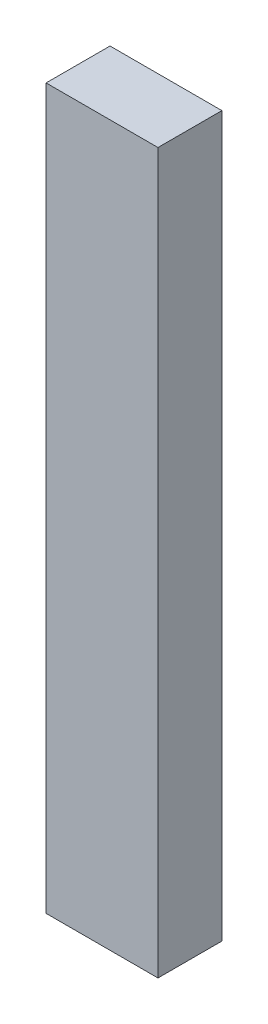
ISO-10303-21;
HEADER;
FILE_DESCRIPTION(('STEP AP214'),'2;1');
FILE_NAME('part.step','',(''),(''),'','','');
FILE_SCHEMA(('AUTOMOTIVE_DESIGN { 1 0 10303 214 1 1 1 1 }'));
ENDSEC;
DATA;
#1=APPLICATION_CONTEXT('core data for automotive mechanical design processes');
#2=APPLICATION_PROTOCOL_DEFINITION('international standard','automotive_design',2000,#1);
#3=PRODUCT_CONTEXT('',#1,'mechanical');
#4=PRODUCT('Part','Part','',(#3));
#5=PRODUCT_RELATED_PRODUCT_CATEGORY('part','',(#4));
#6=PRODUCT_DEFINITION_FORMATION('','',#4);
#7=PRODUCT_DEFINITION_CONTEXT('part definition',#1,'design');
#8=PRODUCT_DEFINITION('design','',#6,#7);
#9=PRODUCT_DEFINITION_SHAPE('','',#8);
#10=(LENGTH_UNIT() NAMED_UNIT(*) SI_UNIT(.MILLI.,.METRE.));
#11=(NAMED_UNIT(*) PLANE_ANGLE_UNIT() SI_UNIT($,.RADIAN.));
#12=(NAMED_UNIT(*) SI_UNIT($,.STERADIAN.) SOLID_ANGLE_UNIT());
#13=UNCERTAINTY_MEASURE_WITH_UNIT(LENGTH_MEASURE(1.E-05),#10,'distance_accuracy_value','');
#14=(GEOMETRIC_REPRESENTATION_CONTEXT(3) GLOBAL_UNCERTAINTY_ASSIGNED_CONTEXT((#13)) GLOBAL_UNIT_ASSIGNED_CONTEXT((#10,
#11,#12)) REPRESENTATION_CONTEXT('',''));
#15=CARTESIAN_POINT('',(0.,0.,0.));
#16=DIRECTION('',(0.,0.,1.));
#17=DIRECTION('',(1.,0.,0.));
#18=AXIS2_PLACEMENT_3D('',#15,#16,#17);
#19=CARTESIAN_POINT('',(0.,0.,8.));
#20=DIRECTION('',(1.,0.,0.));
#21=DIRECTION('',(0.,0.,-1.));
#22=AXIS2_PLACEMENT_3D('',#19,#20,#21);
#23=PLANE('',#22);
#24=DIRECTION('',(0.,-1.,0.));
#25=VECTOR('',#24,1.);
#26=CARTESIAN_POINT('',(0.,0.,0.));
#27=LINE('',#26,#25);
#28=CARTESIAN_POINT('',(0.,90.,0.));
#29=VERTEX_POINT('',#28);
#30=CARTESIAN_POINT('',(0.,0.,0.));
#31=VERTEX_POINT('',#30);
#32=EDGE_CURVE('E94',#29,#31,#27,.T.);
#33=ORIENTED_EDGE('',*,*,#32,.T.);
#34=DIRECTION('',(0.,0.,-1.));
#35=VECTOR('',#34,1.);
#36=CARTESIAN_POINT('',(0.,0.,8.));
#37=LINE('',#36,#35);
#38=CARTESIAN_POINT('',(0.,0.,8.));
#39=VERTEX_POINT('',#38);
#40=EDGE_CURVE('E11',#39,#31,#37,.T.);
#41=ORIENTED_EDGE('',*,*,#40,.F.);
#42=DIRECTION('',(0.,-1.,0.));
#43=VECTOR('',#42,1.);
#44=CARTESIAN_POINT('',(0.,0.,8.));
#45=LINE('',#44,#43);
#46=CARTESIAN_POINT('',(0.,90.,8.));
#47=VERTEX_POINT('',#46);
#48=EDGE_CURVE('E82',#47,#39,#45,.T.);
#49=ORIENTED_EDGE('',*,*,#48,.F.);
#50=DIRECTION('',(0.,0.,-1.));
#51=VECTOR('',#50,1.);
#52=CARTESIAN_POINT('',(0.,90.,8.));
#53=LINE('',#52,#51);
#54=EDGE_CURVE('E90',#47,#29,#53,.T.);
#55=ORIENTED_EDGE('',*,*,#54,.T.);
#56=EDGE_LOOP('',(#33,#41,#49,#55));
#57=FACE_BOUND('',#56,.T.);
#58=ADVANCED_FACE('F31',(#57),#23,.F.);
#59=CARTESIAN_POINT('',(0.,0.,8.));
#60=DIRECTION('',(0.,1.,0.));
#61=DIRECTION('',(0.,0.,1.));
#62=AXIS2_PLACEMENT_3D('',#59,#60,#61);
#63=PLANE('',#62);
#64=DIRECTION('',(1.,0.,0.));
#65=VECTOR('',#64,1.);
#66=CARTESIAN_POINT('',(0.,0.,0.));
#67=LINE('',#66,#65);
#68=CARTESIAN_POINT('',(14.,0.,0.));
#69=VERTEX_POINT('',#68);
#70=EDGE_CURVE('E86',#31,#69,#67,.T.);
#71=ORIENTED_EDGE('',*,*,#70,.T.);
#72=DIRECTION('',(0.,0.,-1.));
#73=VECTOR('',#72,1.);
#74=CARTESIAN_POINT('',(14.,0.,8.));
#75=LINE('',#74,#73);
#76=CARTESIAN_POINT('',(14.,0.,8.));
#77=VERTEX_POINT('',#76);
#78=EDGE_CURVE('E39',#77,#69,#75,.T.);
#79=ORIENTED_EDGE('',*,*,#78,.F.);
#80=DIRECTION('',(1.,0.,0.));
#81=VECTOR('',#80,1.);
#82=CARTESIAN_POINT('',(0.,0.,8.));
#83=LINE('',#82,#81);
#84=EDGE_CURVE('E77',#39,#77,#83,.T.);
#85=ORIENTED_EDGE('',*,*,#84,.F.);
#86=ORIENTED_EDGE('',*,*,#40,.T.);
#87=EDGE_LOOP('',(#71,#79,#85,#86));
#88=FACE_BOUND('',#87,.T.);
#89=ADVANCED_FACE('F85',(#88),#63,.F.);
#90=CARTESIAN_POINT('',(14.,0.,8.));
#91=DIRECTION('',(-1.,0.,0.));
#92=DIRECTION('',(0.,0.,1.));
#93=AXIS2_PLACEMENT_3D('',#90,#91,#92);
#94=PLANE('',#93);
#95=DIRECTION('',(0.,1.,0.));
#96=VECTOR('',#95,1.);
#97=CARTESIAN_POINT('',(14.,0.,0.));
#98=LINE('',#97,#96);
#99=CARTESIAN_POINT('',(14.,90.,0.));
#100=VERTEX_POINT('',#99);
#101=EDGE_CURVE('E64',#69,#100,#98,.T.);
#102=ORIENTED_EDGE('',*,*,#101,.T.);
#103=DIRECTION('',(0.,0.,-1.));
#104=VECTOR('',#103,1.);
#105=CARTESIAN_POINT('',(14.,90.,8.));
#106=LINE('',#105,#104);
#107=CARTESIAN_POINT('',(14.,90.,8.));
#108=VERTEX_POINT('',#107);
#109=EDGE_CURVE('E87',#108,#100,#106,.T.);
#110=ORIENTED_EDGE('',*,*,#109,.F.);
#111=DIRECTION('',(0.,1.,0.));
#112=VECTOR('',#111,1.);
#113=CARTESIAN_POINT('',(14.,0.,8.));
#114=LINE('',#113,#112);
#115=EDGE_CURVE('E80',#77,#108,#114,.T.);
#116=ORIENTED_EDGE('',*,*,#115,.F.);
#117=ORIENTED_EDGE('',*,*,#78,.T.);
#118=EDGE_LOOP('',(#102,#110,#116,#117));
#119=FACE_BOUND('',#118,.T.);
#120=ADVANCED_FACE('F88',(#119),#94,.F.);
#121=CARTESIAN_POINT('',(0.,90.,8.));
#122=DIRECTION('',(0.,-1.,0.));
#123=DIRECTION('',(0.,0.,-1.));
#124=AXIS2_PLACEMENT_3D('',#121,#122,#123);
#125=PLANE('',#124);
#126=DIRECTION('',(-1.,0.,0.));
#127=VECTOR('',#126,1.);
#128=CARTESIAN_POINT('',(0.,90.,0.));
#129=LINE('',#128,#127);
#130=EDGE_CURVE('E70',#100,#29,#129,.T.);
#131=ORIENTED_EDGE('',*,*,#130,.T.);
#132=ORIENTED_EDGE('',*,*,#54,.F.);
#133=DIRECTION('',(-1.,0.,0.));
#134=VECTOR('',#133,1.);
#135=CARTESIAN_POINT('',(0.,90.,8.));
#136=LINE('',#135,#134);
#137=EDGE_CURVE('E47',#108,#47,#136,.T.);
#138=ORIENTED_EDGE('',*,*,#137,.F.);
#139=ORIENTED_EDGE('',*,*,#109,.T.);
#140=EDGE_LOOP('',(#131,#132,#138,#139));
#141=FACE_BOUND('',#140,.T.);
#142=ADVANCED_FACE('F101',(#141),#125,.F.);
#143=CARTESIAN_POINT('',(0.,90.,8.));
#144=DIRECTION('',(0.,0.,-1.));
#145=DIRECTION('',(-1.,0.,0.));
#146=AXIS2_PLACEMENT_3D('',#143,#144,#145);
#147=PLANE('',#146);
#148=ORIENTED_EDGE('',*,*,#48,.T.);
#149=ORIENTED_EDGE('',*,*,#84,.T.);
#150=ORIENTED_EDGE('',*,*,#115,.T.);
#151=ORIENTED_EDGE('',*,*,#137,.T.);
#152=EDGE_LOOP('',(#148,#149,#150,#151));
#153=FACE_BOUND('',#152,.T.);
#154=ADVANCED_FACE('F78',(#153),#147,.F.);
#155=CARTESIAN_POINT('',(0.,90.,0.));
#156=DIRECTION('',(0.,0.,-1.));
#157=DIRECTION('',(-1.,0.,0.));
#158=AXIS2_PLACEMENT_3D('',#155,#156,#157);
#159=PLANE('',#158);
#160=ORIENTED_EDGE('',*,*,#32,.F.);
#161=ORIENTED_EDGE('',*,*,#130,.F.);
#162=ORIENTED_EDGE('',*,*,#101,.F.);
#163=ORIENTED_EDGE('',*,*,#70,.F.);
#164=EDGE_LOOP('',(#160,#161,#162,#163));
#165=FACE_BOUND('',#164,.T.);
#166=ADVANCED_FACE('F104',(#165),#159,.T.);
#167=CLOSED_SHELL('',(#58,#89,#120,#142,#154,#166));
#168=MANIFOLD_SOLID_BREP('B2',#167);
#169=ADVANCED_BREP_SHAPE_REPRESENTATION('',(#18,#168),#14);
#170=SHAPE_DEFINITION_REPRESENTATION(#9,#169);
ENDSEC;
END-ISO-10303-21;
